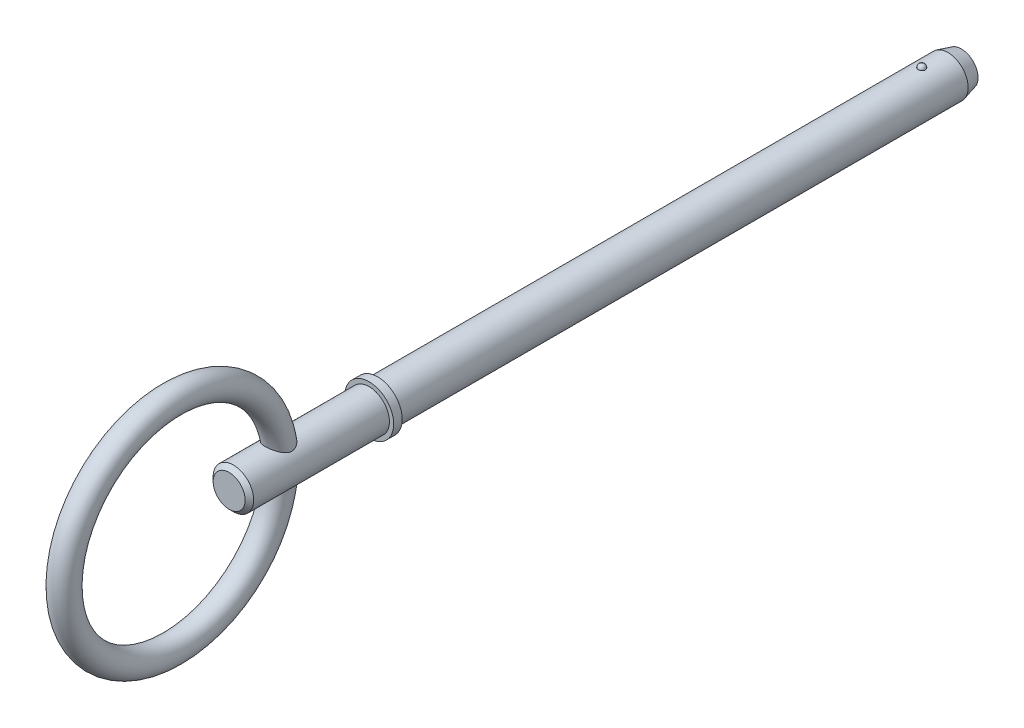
from build123d import *

# Parameters (mm, degrees)
SKETCH2_R           = 2.38
BOSS_EXTRUDE1_DEPTH = 63.5
BOSS_EXTRUDE2_START = 5.08
SKETCH3_R           = 2.38
BOSS_EXTRUDE2_DEPTH = 5.08
CHAMFER1_SIZE       = 1.586
CHAMFER1_SIZE2      = 0.424967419
SKETCH20_W          = 1
SKETCH20_H          = 2.88
SKETCH21_R          = 2.38
BOSS_EXTRUDE3_DEPTH = 17.45
CHAMFER2_SIZE       = 0.5
SKETCH24_R          = 1.5


with BuildPart() as part:
    # Sketch2 → Boss-Extrude1 (new body)
    with BuildSketch(Plane.XY):
        Circle(SKETCH2_R)
    extrude(amount=BOSS_EXTRUDE1_DEPTH)

    # Sketch3 → Boss-Extrude2 (add)
    with BuildSketch(Plane(origin=(0, 0, 0), x_dir=(-1, 0, 0), z_dir=(0, 0, -1)).offset(BOSS_EXTRUDE2_START)):
        Circle(SKETCH3_R)
    extrude(amount=-BOSS_EXTRUDE2_DEPTH)

    # Chamfer1
    chamfer1_edges = [part.edges().sort_by_distance(p)[0] for p in [
        (2.38, 0, -5.08),
    ]]
    chamfer1_side = [part.faces().sort_by_distance(p)[0] for p in [
        (2.38, 0, -2.54),
    ]]
    chamfer(chamfer1_edges, length=CHAMFER1_SIZE, length2=CHAMFER1_SIZE2, reference=chamfer1_side[0])

    # Sketch18 → Revolve1 (revolve)
    with BuildSketch(Plane(origin=(0, 0, 0), x_dir=(0, 0, -1), z_dir=(1, 0, 0))):
        with BuildLine():
            Line((0.42, 2.8), (0.42, 1.96))
            ThreePointArc((0.42, 1.96), (0, 2.38), (0.42, 2.8))
        make_face()
    revolve(axis=Axis((0, 2.8, -0.42), (0, -1, 0)))

    # Sketch20 → Revolve2 (revolve)
    with BuildSketch(Plane(origin=(0, 0, 0), x_dir=(0, 0, -1), z_dir=(1, 0, 0)), mode=Mode.PRIVATE) as revolve2_sk:
        with Locations((-64, 1.44)):
            Rectangle(SKETCH20_W, SKETCH20_H)
    revolve(revolve2_sk.sketch.rotate(Axis((0, 0, 33.728787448), (0, 0, 1)), 90), axis=Axis((0, 0, 33.728787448), (0, 0, 1)))

    # Sketch21 → Boss-Extrude3 (add)
    with BuildSketch(Plane(origin=(0, 0, 63.5), x_dir=(-1, 0, 0), z_dir=(0, 0, -1))):
        Circle(SKETCH21_R)
    extrude(amount=-BOSS_EXTRUDE3_DEPTH)

    # Chamfer2
    chamfer2_edges = [part.edges().sort_by_distance(p)[0] for p in [
        (2.38, 0, 80.95),
    ]]
    chamfer(chamfer2_edges, length=CHAMFER2_SIZE)

    # Sweep1: sweep along a path in Sketch23
    with BuildLine(Plane(origin=(0, 0, 0), x_dir=(0, 0, -1), z_dir=(1, 0, 0))) as sweep1_path:
        CenterArc((-87.65, 0), 12.7, 0, 360)
    # Sketch24 → Sweep1 (sweep)
    with BuildSketch(Plane(origin=(0, 0, 0), x_dir=(1, 0, 0), z_dir=(0, 1, 0))):
        with Locations((0, -74.95)):
            Circle(SKETCH24_R)
    sweep(path=sweep1_path.line)


solid = part.part
